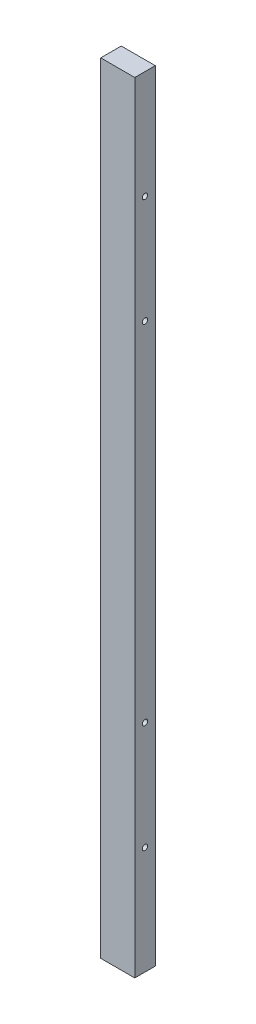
ISO-10303-21;
HEADER;
FILE_DESCRIPTION(('STEP AP214'),'2;1');
FILE_NAME('part.step','',(''),(''),'','','');
FILE_SCHEMA(('AUTOMOTIVE_DESIGN { 1 0 10303 214 1 1 1 1 }'));
ENDSEC;
DATA;
#1=APPLICATION_CONTEXT('core data for automotive mechanical design processes');
#2=APPLICATION_PROTOCOL_DEFINITION('international standard','automotive_design',2000,#1);
#3=PRODUCT_CONTEXT('',#1,'mechanical');
#4=PRODUCT('Part','Part','',(#3));
#5=PRODUCT_RELATED_PRODUCT_CATEGORY('part','',(#4));
#6=PRODUCT_DEFINITION_FORMATION('','',#4);
#7=PRODUCT_DEFINITION_CONTEXT('part definition',#1,'design');
#8=PRODUCT_DEFINITION('design','',#6,#7);
#9=PRODUCT_DEFINITION_SHAPE('','',#8);
#10=(LENGTH_UNIT() NAMED_UNIT(*) SI_UNIT(.MILLI.,.METRE.));
#11=(NAMED_UNIT(*) PLANE_ANGLE_UNIT() SI_UNIT($,.RADIAN.));
#12=(NAMED_UNIT(*) SI_UNIT($,.STERADIAN.) SOLID_ANGLE_UNIT());
#13=UNCERTAINTY_MEASURE_WITH_UNIT(LENGTH_MEASURE(1.E-05),#10,'distance_accuracy_value','');
#14=(GEOMETRIC_REPRESENTATION_CONTEXT(3) GLOBAL_UNCERTAINTY_ASSIGNED_CONTEXT((#13)) GLOBAL_UNIT_ASSIGNED_CONTEXT((#10,
#11,#12)) REPRESENTATION_CONTEXT('',''));
#15=CARTESIAN_POINT('',(0.,0.,0.));
#16=DIRECTION('',(0.,0.,1.));
#17=DIRECTION('',(1.,0.,0.));
#18=AXIS2_PLACEMENT_3D('',#15,#16,#17);
#19=CARTESIAN_POINT('',(0.,0.,38.));
#20=DIRECTION('',(1.,0.,0.));
#21=DIRECTION('',(0.,0.,-1.));
#22=AXIS2_PLACEMENT_3D('',#19,#20,#21);
#23=PLANE('',#22);
#24=CARTESIAN_POINT('',(0.,1244.,19.));
#25=DIRECTION('',(-1.,0.,0.));
#26=DIRECTION('',(0.,0.,1.));
#27=AXIS2_PLACEMENT_3D('',#24,#25,#26);
#28=CIRCLE('',#27,5.);
#29=CARTESIAN_POINT('',(0.,1244.,24.));
#30=VERTEX_POINT('',#29);
#31=EDGE_CURVE('E124',#30,#30,#28,.T.);
#32=ORIENTED_EDGE('',*,*,#31,.F.);
#33=EDGE_LOOP('',(#32));
#34=FACE_BOUND('',#33,.T.);
#35=CARTESIAN_POINT('',(0.,400.,19.));
#36=DIRECTION('',(-1.,0.,0.));
#37=DIRECTION('',(0.,0.,-1.));
#38=AXIS2_PLACEMENT_3D('',#35,#36,#37);
#39=CIRCLE('',#38,5.);
#40=CARTESIAN_POINT('',(0.,400.,14.));
#41=VERTEX_POINT('',#40);
#42=EDGE_CURVE('E129',#41,#41,#39,.T.);
#43=ORIENTED_EDGE('',*,*,#42,.F.);
#44=EDGE_LOOP('',(#43));
#45=FACE_BOUND('',#44,.T.);
#46=CARTESIAN_POINT('',(0.,200.,19.));
#47=DIRECTION('',(-1.,0.,0.));
#48=DIRECTION('',(0.,0.,-1.));
#49=AXIS2_PLACEMENT_3D('',#46,#47,#48);
#50=CIRCLE('',#49,5.);
#51=CARTESIAN_POINT('',(0.,200.,14.));
#52=VERTEX_POINT('',#51);
#53=EDGE_CURVE('E117',#52,#52,#50,.T.);
#54=ORIENTED_EDGE('',*,*,#53,.F.);
#55=EDGE_LOOP('',(#54));
#56=FACE_BOUND('',#55,.T.);
#57=CARTESIAN_POINT('',(0.,1044.,19.));
#58=DIRECTION('',(-1.,0.,0.));
#59=DIRECTION('',(0.,0.,1.));
#60=AXIS2_PLACEMENT_3D('',#57,#58,#59);
#61=CIRCLE('',#60,5.);
#62=CARTESIAN_POINT('',(0.,1044.,24.));
#63=VERTEX_POINT('',#62);
#64=EDGE_CURVE('E116',#63,#63,#61,.T.);
#65=ORIENTED_EDGE('',*,*,#64,.F.);
#66=EDGE_LOOP('',(#65));
#67=FACE_BOUND('',#66,.T.);
#68=DIRECTION('',(0.,-1.,0.));
#69=VECTOR('',#68,1.);
#70=CARTESIAN_POINT('',(0.,0.,0.));
#71=LINE('',#70,#69);
#72=CARTESIAN_POINT('',(0.,1444.,0.));
#73=VERTEX_POINT('',#72);
#74=CARTESIAN_POINT('',(0.,0.,0.));
#75=VERTEX_POINT('',#74);
#76=EDGE_CURVE('E99',#73,#75,#71,.T.);
#77=ORIENTED_EDGE('',*,*,#76,.T.);
#78=DIRECTION('',(0.,0.,-1.));
#79=VECTOR('',#78,1.);
#80=CARTESIAN_POINT('',(0.,0.,38.));
#81=LINE('',#80,#79);
#82=CARTESIAN_POINT('',(0.,0.,38.));
#83=VERTEX_POINT('',#82);
#84=EDGE_CURVE('E11',#83,#75,#81,.T.);
#85=ORIENTED_EDGE('',*,*,#84,.F.);
#86=DIRECTION('',(0.,-1.,0.));
#87=VECTOR('',#86,1.);
#88=CARTESIAN_POINT('',(0.,0.,38.));
#89=LINE('',#88,#87);
#90=CARTESIAN_POINT('',(0.,1444.,38.));
#91=VERTEX_POINT('',#90);
#92=EDGE_CURVE('E87',#91,#83,#89,.T.);
#93=ORIENTED_EDGE('',*,*,#92,.F.);
#94=DIRECTION('',(0.,0.,-1.));
#95=VECTOR('',#94,1.);
#96=CARTESIAN_POINT('',(0.,1444.,38.));
#97=LINE('',#96,#95);
#98=EDGE_CURVE('E95',#91,#73,#97,.T.);
#99=ORIENTED_EDGE('',*,*,#98,.T.);
#100=EDGE_LOOP('',(#77,#85,#93,#99));
#101=FACE_BOUND('',#100,.T.);
#102=ADVANCED_FACE('F36',(#34,#45,#56,#67,#101),#23,.F.);
#103=CARTESIAN_POINT('',(0.,0.,38.));
#104=DIRECTION('',(0.,1.,0.));
#105=DIRECTION('',(0.,0.,1.));
#106=AXIS2_PLACEMENT_3D('',#103,#104,#105);
#107=PLANE('',#106);
#108=DIRECTION('',(1.,0.,0.));
#109=VECTOR('',#108,1.);
#110=CARTESIAN_POINT('',(0.,0.,0.));
#111=LINE('',#110,#109);
#112=CARTESIAN_POINT('',(63.,0.,0.));
#113=VERTEX_POINT('',#112);
#114=EDGE_CURVE('E91',#75,#113,#111,.T.);
#115=ORIENTED_EDGE('',*,*,#114,.T.);
#116=DIRECTION('',(0.,0.,-1.));
#117=VECTOR('',#116,1.);
#118=CARTESIAN_POINT('',(63.,0.,38.));
#119=LINE('',#118,#117);
#120=CARTESIAN_POINT('',(63.,0.,38.));
#121=VERTEX_POINT('',#120);
#122=EDGE_CURVE('E44',#121,#113,#119,.T.);
#123=ORIENTED_EDGE('',*,*,#122,.F.);
#124=DIRECTION('',(1.,0.,0.));
#125=VECTOR('',#124,1.);
#126=CARTESIAN_POINT('',(0.,0.,38.));
#127=LINE('',#126,#125);
#128=EDGE_CURVE('E82',#83,#121,#127,.T.);
#129=ORIENTED_EDGE('',*,*,#128,.F.);
#130=ORIENTED_EDGE('',*,*,#84,.T.);
#131=EDGE_LOOP('',(#115,#123,#129,#130));
#132=FACE_BOUND('',#131,.T.);
#133=ADVANCED_FACE('F90',(#132),#107,.F.);
#134=CARTESIAN_POINT('',(63.,0.,38.));
#135=DIRECTION('',(-1.,0.,0.));
#136=DIRECTION('',(0.,0.,1.));
#137=AXIS2_PLACEMENT_3D('',#134,#135,#136);
#138=PLANE('',#137);
#139=CARTESIAN_POINT('',(63.,1244.,19.));
#140=DIRECTION('',(-1.,0.,0.));
#141=DIRECTION('',(0.,0.,1.));
#142=AXIS2_PLACEMENT_3D('',#139,#140,#141);
#143=CIRCLE('',#142,5.);
#144=CARTESIAN_POINT('',(63.,1244.,24.));
#145=VERTEX_POINT('',#144);
#146=EDGE_CURVE('E102',#145,#145,#143,.F.);
#147=ORIENTED_EDGE('',*,*,#146,.F.);
#148=EDGE_LOOP('',(#147));
#149=FACE_BOUND('',#148,.T.);
#150=CARTESIAN_POINT('',(63.,400.,19.));
#151=DIRECTION('',(-1.,0.,0.));
#152=DIRECTION('',(0.,0.,1.));
#153=AXIS2_PLACEMENT_3D('',#150,#151,#152);
#154=CIRCLE('',#153,5.);
#155=CARTESIAN_POINT('',(63.,400.,24.));
#156=VERTEX_POINT('',#155);
#157=EDGE_CURVE('E120',#156,#156,#154,.F.);
#158=ORIENTED_EDGE('',*,*,#157,.F.);
#159=EDGE_LOOP('',(#158));
#160=FACE_BOUND('',#159,.T.);
#161=CARTESIAN_POINT('',(63.,200.,19.));
#162=DIRECTION('',(-1.,0.,0.));
#163=DIRECTION('',(0.,0.,1.));
#164=AXIS2_PLACEMENT_3D('',#161,#162,#163);
#165=CIRCLE('',#164,5.);
#166=CARTESIAN_POINT('',(63.,200.,24.));
#167=VERTEX_POINT('',#166);
#168=EDGE_CURVE('E113',#167,#167,#165,.F.);
#169=ORIENTED_EDGE('',*,*,#168,.F.);
#170=EDGE_LOOP('',(#169));
#171=FACE_BOUND('',#170,.T.);
#172=CARTESIAN_POINT('',(63.,1044.,19.));
#173=DIRECTION('',(-1.,0.,0.));
#174=DIRECTION('',(0.,0.,1.));
#175=AXIS2_PLACEMENT_3D('',#172,#173,#174);
#176=CIRCLE('',#175,5.);
#177=CARTESIAN_POINT('',(63.,1044.,24.));
#178=VERTEX_POINT('',#177);
#179=EDGE_CURVE('E121',#178,#178,#176,.F.);
#180=ORIENTED_EDGE('',*,*,#179,.F.);
#181=EDGE_LOOP('',(#180));
#182=FACE_BOUND('',#181,.T.);
#183=DIRECTION('',(0.,1.,0.));
#184=VECTOR('',#183,1.);
#185=CARTESIAN_POINT('',(63.,0.,0.));
#186=LINE('',#185,#184);
#187=CARTESIAN_POINT('',(63.,1444.,0.));
#188=VERTEX_POINT('',#187);
#189=EDGE_CURVE('E69',#113,#188,#186,.T.);
#190=ORIENTED_EDGE('',*,*,#189,.T.);
#191=DIRECTION('',(0.,0.,-1.));
#192=VECTOR('',#191,1.);
#193=CARTESIAN_POINT('',(63.,1444.,38.));
#194=LINE('',#193,#192);
#195=CARTESIAN_POINT('',(63.,1444.,38.));
#196=VERTEX_POINT('',#195);
#197=EDGE_CURVE('E92',#196,#188,#194,.T.);
#198=ORIENTED_EDGE('',*,*,#197,.F.);
#199=DIRECTION('',(0.,1.,0.));
#200=VECTOR('',#199,1.);
#201=CARTESIAN_POINT('',(63.,0.,38.));
#202=LINE('',#201,#200);
#203=EDGE_CURVE('E85',#121,#196,#202,.T.);
#204=ORIENTED_EDGE('',*,*,#203,.F.);
#205=ORIENTED_EDGE('',*,*,#122,.T.);
#206=EDGE_LOOP('',(#190,#198,#204,#205));
#207=FACE_BOUND('',#206,.T.);
#208=ADVANCED_FACE('F93',(#149,#160,#171,#182,#207),#138,.F.);
#209=CARTESIAN_POINT('',(0.,1444.,38.));
#210=DIRECTION('',(0.,-1.,0.));
#211=DIRECTION('',(0.,0.,-1.));
#212=AXIS2_PLACEMENT_3D('',#209,#210,#211);
#213=PLANE('',#212);
#214=DIRECTION('',(-1.,0.,0.));
#215=VECTOR('',#214,1.);
#216=CARTESIAN_POINT('',(0.,1444.,0.));
#217=LINE('',#216,#215);
#218=EDGE_CURVE('E75',#188,#73,#217,.T.);
#219=ORIENTED_EDGE('',*,*,#218,.T.);
#220=ORIENTED_EDGE('',*,*,#98,.F.);
#221=DIRECTION('',(-1.,0.,0.));
#222=VECTOR('',#221,1.);
#223=CARTESIAN_POINT('',(0.,1444.,38.));
#224=LINE('',#223,#222);
#225=EDGE_CURVE('E52',#196,#91,#224,.T.);
#226=ORIENTED_EDGE('',*,*,#225,.F.);
#227=ORIENTED_EDGE('',*,*,#197,.T.);
#228=EDGE_LOOP('',(#219,#220,#226,#227));
#229=FACE_BOUND('',#228,.T.);
#230=ADVANCED_FACE('F107',(#229),#213,.F.);
#231=CARTESIAN_POINT('',(0.,0.,38.));
#232=DIRECTION('',(0.,0.,-1.));
#233=DIRECTION('',(-1.,0.,0.));
#234=AXIS2_PLACEMENT_3D('',#231,#232,#233);
#235=PLANE('',#234);
#236=ORIENTED_EDGE('',*,*,#92,.T.);
#237=ORIENTED_EDGE('',*,*,#128,.T.);
#238=ORIENTED_EDGE('',*,*,#203,.T.);
#239=ORIENTED_EDGE('',*,*,#225,.T.);
#240=EDGE_LOOP('',(#236,#237,#238,#239));
#241=FACE_BOUND('',#240,.T.);
#242=ADVANCED_FACE('F83',(#241),#235,.F.);
#243=CARTESIAN_POINT('',(0.,0.,0.));
#244=DIRECTION('',(0.,0.,-1.));
#245=DIRECTION('',(-1.,0.,0.));
#246=AXIS2_PLACEMENT_3D('',#243,#244,#245);
#247=PLANE('',#246);
#248=ORIENTED_EDGE('',*,*,#76,.F.);
#249=ORIENTED_EDGE('',*,*,#218,.F.);
#250=ORIENTED_EDGE('',*,*,#189,.F.);
#251=ORIENTED_EDGE('',*,*,#114,.F.);
#252=EDGE_LOOP('',(#248,#249,#250,#251));
#253=FACE_BOUND('',#252,.T.);
#254=ADVANCED_FACE('F110',(#253),#247,.T.);
#255=CARTESIAN_POINT('',(63.001,1044.,19.));
#256=DIRECTION('',(-1.,0.,0.));
#257=DIRECTION('',(0.,0.,1.));
#258=AXIS2_PLACEMENT_3D('',#255,#256,#257);
#259=CYLINDRICAL_SURFACE('',#258,5.);
#260=ORIENTED_EDGE('',*,*,#64,.T.);
#261=EDGE_LOOP('',(#260));
#262=FACE_BOUND('',#261,.T.);
#263=ORIENTED_EDGE('',*,*,#179,.T.);
#264=EDGE_LOOP('',(#263));
#265=FACE_BOUND('',#264,.T.);
#266=ADVANCED_FACE('F148',(#262,#265),#259,.F.);
#267=CARTESIAN_POINT('',(63.001,200.,19.));
#268=DIRECTION('',(-1.,0.,0.));
#269=DIRECTION('',(0.,0.,1.));
#270=AXIS2_PLACEMENT_3D('',#267,#268,#269);
#271=CYLINDRICAL_SURFACE('',#270,5.);
#272=ORIENTED_EDGE('',*,*,#53,.T.);
#273=EDGE_LOOP('',(#272));
#274=FACE_BOUND('',#273,.T.);
#275=ORIENTED_EDGE('',*,*,#168,.T.);
#276=EDGE_LOOP('',(#275));
#277=FACE_BOUND('',#276,.T.);
#278=ADVANCED_FACE('F151',(#274,#277),#271,.F.);
#279=CARTESIAN_POINT('',(63.001,400.,19.));
#280=DIRECTION('',(-1.,0.,0.));
#281=DIRECTION('',(0.,0.,1.));
#282=AXIS2_PLACEMENT_3D('',#279,#280,#281);
#283=CYLINDRICAL_SURFACE('',#282,5.);
#284=ORIENTED_EDGE('',*,*,#42,.T.);
#285=EDGE_LOOP('',(#284));
#286=FACE_BOUND('',#285,.T.);
#287=ORIENTED_EDGE('',*,*,#157,.T.);
#288=EDGE_LOOP('',(#287));
#289=FACE_BOUND('',#288,.T.);
#290=ADVANCED_FACE('F171',(#286,#289),#283,.F.);
#291=CARTESIAN_POINT('',(63.001,1244.,19.));
#292=DIRECTION('',(-1.,0.,0.));
#293=DIRECTION('',(0.,0.,1.));
#294=AXIS2_PLACEMENT_3D('',#291,#292,#293);
#295=CYLINDRICAL_SURFACE('',#294,5.);
#296=ORIENTED_EDGE('',*,*,#31,.T.);
#297=EDGE_LOOP('',(#296));
#298=FACE_BOUND('',#297,.T.);
#299=ORIENTED_EDGE('',*,*,#146,.T.);
#300=EDGE_LOOP('',(#299));
#301=FACE_BOUND('',#300,.T.);
#302=ADVANCED_FACE('F137',(#298,#301),#295,.F.);
#303=CLOSED_SHELL('',(#102,#133,#208,#230,#242,#254,#266,#278,#290,#302));
#304=MANIFOLD_SOLID_BREP('B2',#303);
#305=ADVANCED_BREP_SHAPE_REPRESENTATION('',(#18,#304),#14);
#306=SHAPE_DEFINITION_REPRESENTATION(#9,#305);
ENDSEC;
END-ISO-10303-21;
